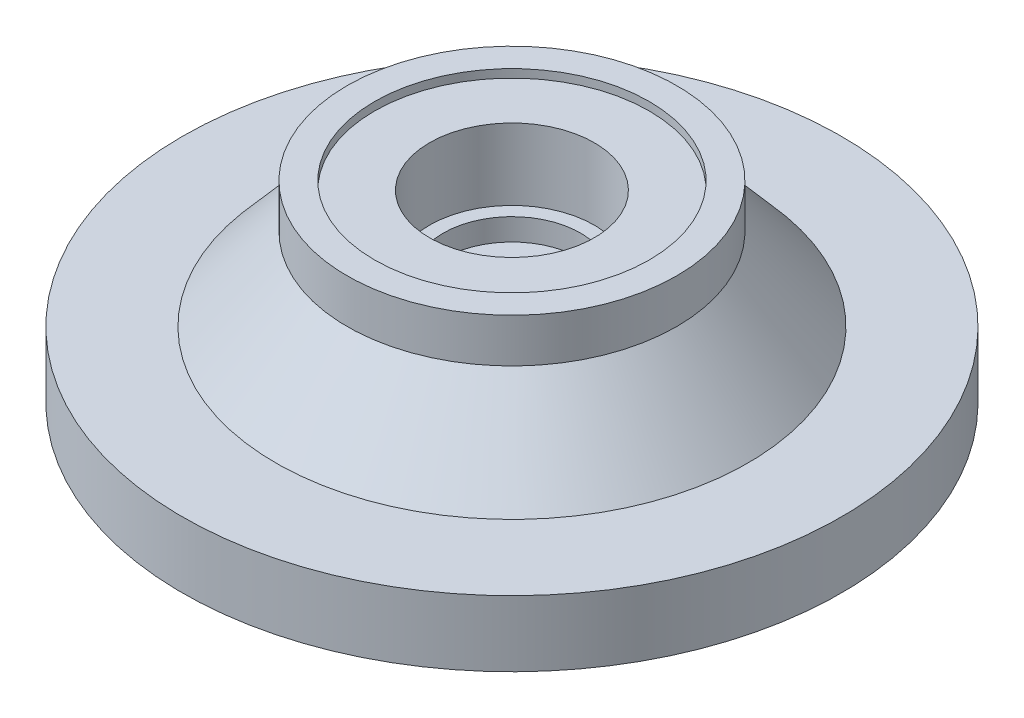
from build123d import *

# Parameters (mm, degrees)
CROQUIS2_R            = 43
CORTAR_EXTRUIR1_DEPTH = 2
CROQUIS4_R            = 40
CORTAR_EXTRUIR2_DEPTH = 3
CORTAR_EXTRUIR3_START = -8.5
CROQUIS6_R            = 30
CORTAR_EXTRUIR3_DEPTH = 8.5
CORTAR_EXTRUIR4_START = -1
CROQUIS8_R            = 30
CORTAR_EXTRUIR4_DEPTH = 1
CROQUIS9_R            = 25
CORTAR_EXTRUIR5_DEPTH = 1.5
CROQUIS10_R           = 15
CORTAR_EXTRUIR6_DEPTH = 13
CROQUIS11_R           = 12.5
CORTAR_EXTRUIR7_DEPTH = 18.5
CROQUIS12_R           = 9
CORTAR_EXTRUIR8_DEPTH = 22.5


with BuildPart() as part:
    # Croquis1 → Revoluci_n1 (revolve)
    with BuildSketch(Plane.XY, mode=Mode.PRIVATE) as revoluci_n1_sk:
        Polygon((0, 0), (60, 0), (60, 12), (43, 12), (30, 27), (30, 35), (0, 35), align=None)
    revolve(revoluci_n1_sk.sketch.rotate(Axis((0, 35, 0), (0, -1, 0)), 180), axis=Axis((0, 35, 0), (0, -1, 0)))

    # Croquis2 → Cortar-Extruir1 (cut)
    with BuildSketch(Plane.XZ):
        Circle(CROQUIS2_R)
    extrude(amount=-CORTAR_EXTRUIR1_DEPTH, mode=Mode.SUBTRACT)

    # Croquis4 → Cortar-Extruir2 (cut)
    with BuildSketch(Plane.XZ.offset(-2)):
        Circle(CROQUIS4_R)
    extrude(amount=-CORTAR_EXTRUIR2_DEPTH, mode=Mode.SUBTRACT)

    # Croquis5 → Revoluci_n2 (revolve)
    with BuildSketch(Plane.XY, mode=Mode.PRIVATE) as revoluci_n2_sk:
        Polygon((-40, 2), (-43, 0), (-43, 2), align=None)
    revolve(revoluci_n2_sk.sketch.rotate(Axis((0, 0, 0), (0, 1, 0)), 270), axis=Axis((0, 0, 0), (0, 1, 0)))

    # Croquis6 → Cortar-Extruir3 (cut)
    with BuildSketch(Plane.XZ.offset(-5).offset(CORTAR_EXTRUIR3_START)):
        with Locations(Location((0, 0, 0), (0, 0, 180))):
            Circle(CROQUIS6_R)
    extrude(amount=CORTAR_EXTRUIR3_DEPTH, mode=Mode.SUBTRACT)

    # Croquis7 → Cortar-Revoluci_n1 (revolve, cut)
    with BuildSketch(Plane.XY, mode=Mode.PRIVATE) as cortar_revoluci_n1_sk:
        Polygon((-40, 5), (-30, 5), (-30, 13.5), align=None)
    revolve(cortar_revoluci_n1_sk.sketch.rotate(Axis((0, 0, 0), (0, 1, 0)), 270), axis=Axis((0, 0, 0), (0, 1, 0)), mode=Mode.SUBTRACT)

    # Croquis8 → Cortar-Extruir4 (cut)
    with BuildSketch(Plane.XZ.offset(-13.5).offset(CORTAR_EXTRUIR4_START)):
        with Locations(Location((0, 0, 0), (0, 0, 180))):
            Circle(CROQUIS8_R)
    extrude(amount=CORTAR_EXTRUIR4_DEPTH, mode=Mode.SUBTRACT)

    # Croquis9 → Cortar-Extruir5 (cut)
    with BuildSketch(Plane(origin=(0, 35, 0), x_dir=(1, 0, 0), z_dir=(0, 1, 0))):
        with Locations(Location((0, 0, 0), (0, 0, 180))):
            Circle(CROQUIS9_R)
    extrude(amount=-CORTAR_EXTRUIR5_DEPTH, mode=Mode.SUBTRACT)

    # Croquis10 → Cortar-Extruir6 (cut)
    with BuildSketch(Plane(origin=(0, 33.5, 0), x_dir=(1, 0, 0), z_dir=(0, 1, 0))):
        with Locations(Location((0, 0, 0), (0, 0, 180))):
            Circle(CROQUIS10_R)
    extrude(amount=-CORTAR_EXTRUIR6_DEPTH, mode=Mode.SUBTRACT)

    # Croquis11 → Cortar-Extruir7 (cut)
    with BuildSketch(Plane(origin=(0, 35, 0), x_dir=(1, 0, 0), z_dir=(0, 1, 0))):
        with Locations(Location((0, 0, 0), (0, 0, 180))):
            Circle(CROQUIS11_R)
    extrude(amount=-CORTAR_EXTRUIR7_DEPTH, mode=Mode.SUBTRACT)

    # Croquis12 → Cortar-Extruir8 (cut)
    with BuildSketch(Plane(origin=(0, 35, 0), x_dir=(1, 0, 0), z_dir=(0, 1, 0))):
        with Locations(Location((0, 0, 0), (0, 0, 180))):
            Circle(CROQUIS12_R)
    extrude(amount=-CORTAR_EXTRUIR8_DEPTH, mode=Mode.SUBTRACT)


solid = part.part
